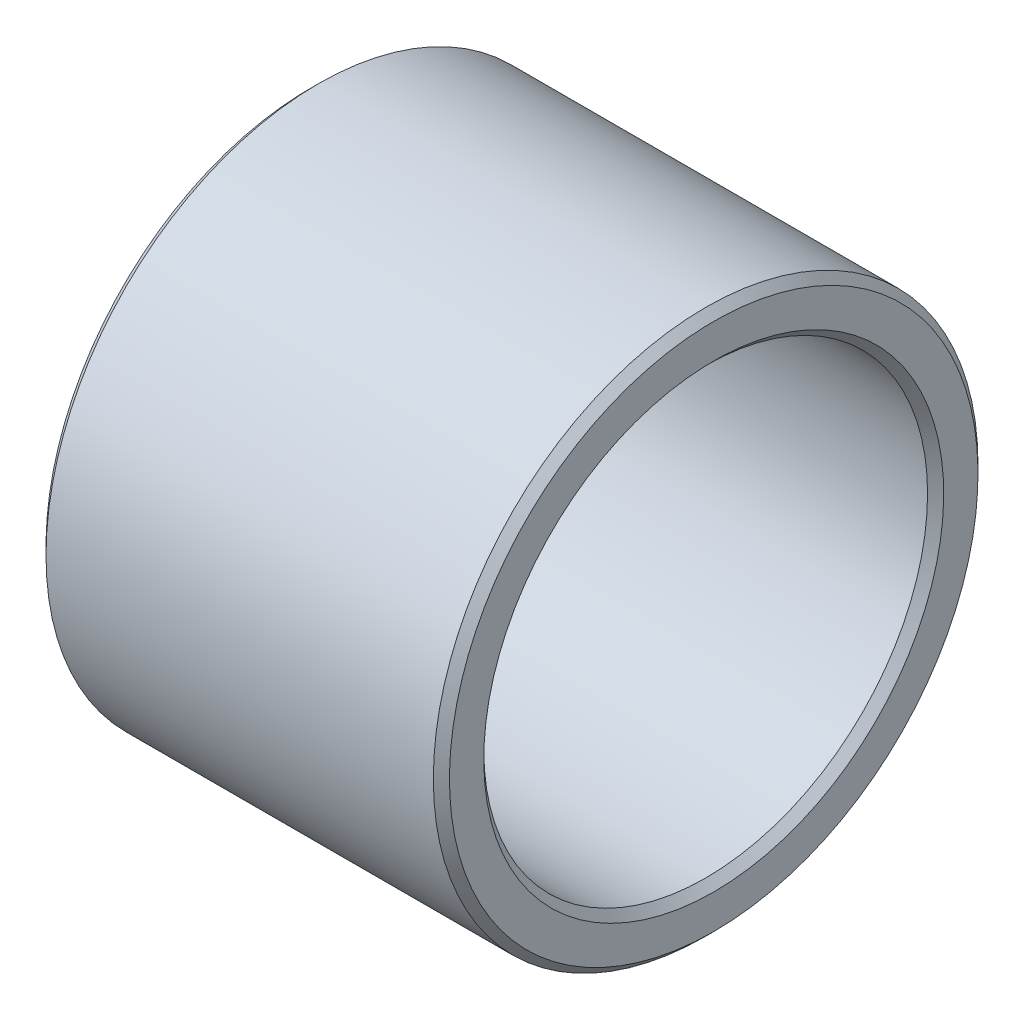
ISO-10303-21;
HEADER;
FILE_DESCRIPTION(('STEP AP214'),'2;1');
FILE_NAME('part.step','',(''),(''),'','','');
FILE_SCHEMA(('AUTOMOTIVE_DESIGN { 1 0 10303 214 1 1 1 1 }'));
ENDSEC;
DATA;
#1=APPLICATION_CONTEXT('core data for automotive mechanical design processes');
#2=APPLICATION_PROTOCOL_DEFINITION('international standard','automotive_design',2000,#1);
#3=PRODUCT_CONTEXT('',#1,'mechanical');
#4=PRODUCT('Part','Part','',(#3));
#5=PRODUCT_RELATED_PRODUCT_CATEGORY('part','',(#4));
#6=PRODUCT_DEFINITION_FORMATION('','',#4);
#7=PRODUCT_DEFINITION_CONTEXT('part definition',#1,'design');
#8=PRODUCT_DEFINITION('design','',#6,#7);
#9=PRODUCT_DEFINITION_SHAPE('','',#8);
#10=(LENGTH_UNIT() NAMED_UNIT(*) SI_UNIT(.MILLI.,.METRE.));
#11=(NAMED_UNIT(*) PLANE_ANGLE_UNIT() SI_UNIT($,.RADIAN.));
#12=(NAMED_UNIT(*) SI_UNIT($,.STERADIAN.) SOLID_ANGLE_UNIT());
#13=UNCERTAINTY_MEASURE_WITH_UNIT(LENGTH_MEASURE(1.E-05),#10,'distance_accuracy_value','');
#14=(GEOMETRIC_REPRESENTATION_CONTEXT(3) GLOBAL_UNCERTAINTY_ASSIGNED_CONTEXT((#13)) GLOBAL_UNIT_ASSIGNED_CONTEXT((#10,
#11,#12)) REPRESENTATION_CONTEXT('',''));
#15=CARTESIAN_POINT('',(0.,0.,0.));
#16=DIRECTION('',(0.,0.,1.));
#17=DIRECTION('',(1.,0.,0.));
#18=AXIS2_PLACEMENT_3D('',#15,#16,#17);
#19=CARTESIAN_POINT('',(0.,-12.25,0.));
#20=DIRECTION('',(-1.,0.,0.));
#21=DIRECTION('',(0.,1.,0.));
#22=AXIS2_PLACEMENT_3D('',#19,#20,#21);
#23=PLANE('',#22);
#24=CARTESIAN_POINT('',(0.,0.,0.));
#25=DIRECTION('',(1.,0.,0.));
#26=DIRECTION('',(0.,-1.,0.));
#27=AXIS2_PLACEMENT_3D('',#24,#25,#26);
#28=CIRCLE('',#27,11.4);
#29=CARTESIAN_POINT('',(0.,-11.4,0.));
#30=VERTEX_POINT('',#29);
#31=EDGE_CURVE('E9',#30,#30,#28,.T.);
#32=ORIENTED_EDGE('',*,*,#31,.T.);
#33=EDGE_LOOP('',(#32));
#34=FACE_BOUND('',#33,.T.);
#35=CARTESIAN_POINT('',(0.,0.,0.));
#36=DIRECTION('',(1.,0.,0.));
#37=DIRECTION('',(0.,-1.,0.));
#38=AXIS2_PLACEMENT_3D('',#35,#36,#37);
#39=CIRCLE('',#38,13.1);
#40=CARTESIAN_POINT('',(0.,-13.1,0.));
#41=VERTEX_POINT('',#40);
#42=EDGE_CURVE('E61',#41,#41,#39,.T.);
#43=ORIENTED_EDGE('',*,*,#42,.F.);
#44=EDGE_LOOP('',(#43));
#45=FACE_BOUND('',#44,.T.);
#46=ADVANCED_FACE('F15',(#34,#45),#23,.T.);
#47=CARTESIAN_POINT('',(0.2,0.,0.));
#48=DIRECTION('',(-1.,0.,0.));
#49=DIRECTION('',(0.,-1.,0.));
#50=AXIS2_PLACEMENT_3D('',#47,#48,#49);
#51=CONICAL_SURFACE('',#50,11.2,0.785398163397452);
#52=CARTESIAN_POINT('',(0.4,0.,0.));
#53=DIRECTION('',(1.,0.,0.));
#54=DIRECTION('',(0.,-1.,0.));
#55=AXIS2_PLACEMENT_3D('',#52,#53,#54);
#56=CIRCLE('',#55,11.);
#57=CARTESIAN_POINT('',(0.4,-11.,0.));
#58=VERTEX_POINT('',#57);
#59=EDGE_CURVE('E18',#58,#58,#56,.T.);
#60=ORIENTED_EDGE('',*,*,#59,.T.);
#61=EDGE_LOOP('',(#60));
#62=FACE_BOUND('',#61,.T.);
#63=ORIENTED_EDGE('',*,*,#31,.F.);
#64=EDGE_LOOP('',(#63));
#65=FACE_BOUND('',#64,.T.);
#66=ADVANCED_FACE('F80',(#62,#65),#51,.F.);
#67=CARTESIAN_POINT('',(10.,0.,0.));
#68=DIRECTION('',(-1.,0.,0.));
#69=DIRECTION('',(0.,-1.,0.));
#70=AXIS2_PLACEMENT_3D('',#67,#68,#69);
#71=CYLINDRICAL_SURFACE('',#70,11.);
#72=CARTESIAN_POINT('',(19.6,0.,0.));
#73=DIRECTION('',(1.,0.,0.));
#74=DIRECTION('',(0.,-1.,0.));
#75=AXIS2_PLACEMENT_3D('',#72,#73,#74);
#76=CIRCLE('',#75,11.);
#77=CARTESIAN_POINT('',(19.6,-11.,0.));
#78=VERTEX_POINT('',#77);
#79=EDGE_CURVE('E54',#78,#78,#76,.T.);
#80=ORIENTED_EDGE('',*,*,#79,.T.);
#81=EDGE_LOOP('',(#80));
#82=FACE_BOUND('',#81,.T.);
#83=ORIENTED_EDGE('',*,*,#59,.F.);
#84=EDGE_LOOP('',(#83));
#85=FACE_BOUND('',#84,.T.);
#86=ADVANCED_FACE('F84',(#82,#85),#71,.F.);
#87=CARTESIAN_POINT('',(19.8,0.,0.));
#88=DIRECTION('',(1.,0.,0.));
#89=DIRECTION('',(0.,-1.,0.));
#90=AXIS2_PLACEMENT_3D('',#87,#88,#89);
#91=CONICAL_SURFACE('',#90,11.2,0.785398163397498);
#92=CARTESIAN_POINT('',(20.,0.,0.));
#93=DIRECTION('',(1.,0.,0.));
#94=DIRECTION('',(0.,-1.,0.));
#95=AXIS2_PLACEMENT_3D('',#92,#93,#94);
#96=CIRCLE('',#95,11.4);
#97=CARTESIAN_POINT('',(20.,-11.4,0.));
#98=VERTEX_POINT('',#97);
#99=EDGE_CURVE('E50',#98,#98,#96,.T.);
#100=ORIENTED_EDGE('',*,*,#99,.T.);
#101=EDGE_LOOP('',(#100));
#102=FACE_BOUND('',#101,.T.);
#103=ORIENTED_EDGE('',*,*,#79,.F.);
#104=EDGE_LOOP('',(#103));
#105=FACE_BOUND('',#104,.T.);
#106=ADVANCED_FACE('F51',(#102,#105),#91,.F.);
#107=CARTESIAN_POINT('',(20.,-12.25,0.));
#108=DIRECTION('',(1.,0.,0.));
#109=DIRECTION('',(0.,-1.,0.));
#110=AXIS2_PLACEMENT_3D('',#107,#108,#109);
#111=PLANE('',#110);
#112=CARTESIAN_POINT('',(20.,0.,0.));
#113=DIRECTION('',(1.,0.,0.));
#114=DIRECTION('',(0.,-1.,0.));
#115=AXIS2_PLACEMENT_3D('',#112,#113,#114);
#116=CIRCLE('',#115,13.1);
#117=CARTESIAN_POINT('',(20.,-13.1,0.));
#118=VERTEX_POINT('',#117);
#119=EDGE_CURVE('E55',#118,#118,#116,.T.);
#120=ORIENTED_EDGE('',*,*,#119,.T.);
#121=EDGE_LOOP('',(#120));
#122=FACE_BOUND('',#121,.T.);
#123=ORIENTED_EDGE('',*,*,#99,.F.);
#124=EDGE_LOOP('',(#123));
#125=FACE_BOUND('',#124,.T.);
#126=ADVANCED_FACE('F94',(#122,#125),#111,.T.);
#127=CARTESIAN_POINT('',(19.8,0.,0.));
#128=DIRECTION('',(-1.,0.,0.));
#129=DIRECTION('',(0.,-1.,0.));
#130=AXIS2_PLACEMENT_3D('',#127,#128,#129);
#131=CONICAL_SURFACE('',#130,13.3,0.785398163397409);
#132=CARTESIAN_POINT('',(19.6,0.,0.));
#133=DIRECTION('',(1.,0.,0.));
#134=DIRECTION('',(0.,-1.,0.));
#135=AXIS2_PLACEMENT_3D('',#132,#133,#134);
#136=CIRCLE('',#135,13.5);
#137=CARTESIAN_POINT('',(19.6,-13.5,0.));
#138=VERTEX_POINT('',#137);
#139=EDGE_CURVE('E57',#138,#138,#136,.T.);
#140=ORIENTED_EDGE('',*,*,#139,.T.);
#141=EDGE_LOOP('',(#140));
#142=FACE_BOUND('',#141,.T.);
#143=ORIENTED_EDGE('',*,*,#119,.F.);
#144=EDGE_LOOP('',(#143));
#145=FACE_BOUND('',#144,.T.);
#146=ADVANCED_FACE('F77',(#142,#145),#131,.T.);
#147=CARTESIAN_POINT('',(10.,0.,0.));
#148=DIRECTION('',(-1.,0.,0.));
#149=DIRECTION('',(0.,-1.,0.));
#150=AXIS2_PLACEMENT_3D('',#147,#148,#149);
#151=CYLINDRICAL_SURFACE('',#150,13.5);
#152=CARTESIAN_POINT('',(0.4,0.,0.));
#153=DIRECTION('',(1.,0.,0.));
#154=DIRECTION('',(0.,-1.,0.));
#155=AXIS2_PLACEMENT_3D('',#152,#153,#154);
#156=CIRCLE('',#155,13.5);
#157=CARTESIAN_POINT('',(0.4,-13.5,0.));
#158=VERTEX_POINT('',#157);
#159=EDGE_CURVE('E62',#158,#158,#156,.T.);
#160=ORIENTED_EDGE('',*,*,#159,.T.);
#161=EDGE_LOOP('',(#160));
#162=FACE_BOUND('',#161,.T.);
#163=ORIENTED_EDGE('',*,*,#139,.F.);
#164=EDGE_LOOP('',(#163));
#165=FACE_BOUND('',#164,.T.);
#166=ADVANCED_FACE('F66',(#162,#165),#151,.T.);
#167=CARTESIAN_POINT('',(0.2,0.,0.));
#168=DIRECTION('',(1.,0.,0.));
#169=DIRECTION('',(0.,-1.,0.));
#170=AXIS2_PLACEMENT_3D('',#167,#168,#169);
#171=CONICAL_SURFACE('',#170,13.3,0.785398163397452);
#172=ORIENTED_EDGE('',*,*,#42,.T.);
#173=EDGE_LOOP('',(#172));
#174=FACE_BOUND('',#173,.T.);
#175=ORIENTED_EDGE('',*,*,#159,.F.);
#176=EDGE_LOOP('',(#175));
#177=FACE_BOUND('',#176,.T.);
#178=ADVANCED_FACE('F69',(#174,#177),#171,.T.);
#179=CLOSED_SHELL('',(#46,#66,#86,#106,#126,#146,#166,#178));
#180=MANIFOLD_SOLID_BREP('B1',#179);
#181=ADVANCED_BREP_SHAPE_REPRESENTATION('',(#18,#180),#14);
#182=SHAPE_DEFINITION_REPRESENTATION(#9,#181);
ENDSEC;
END-ISO-10303-21;
